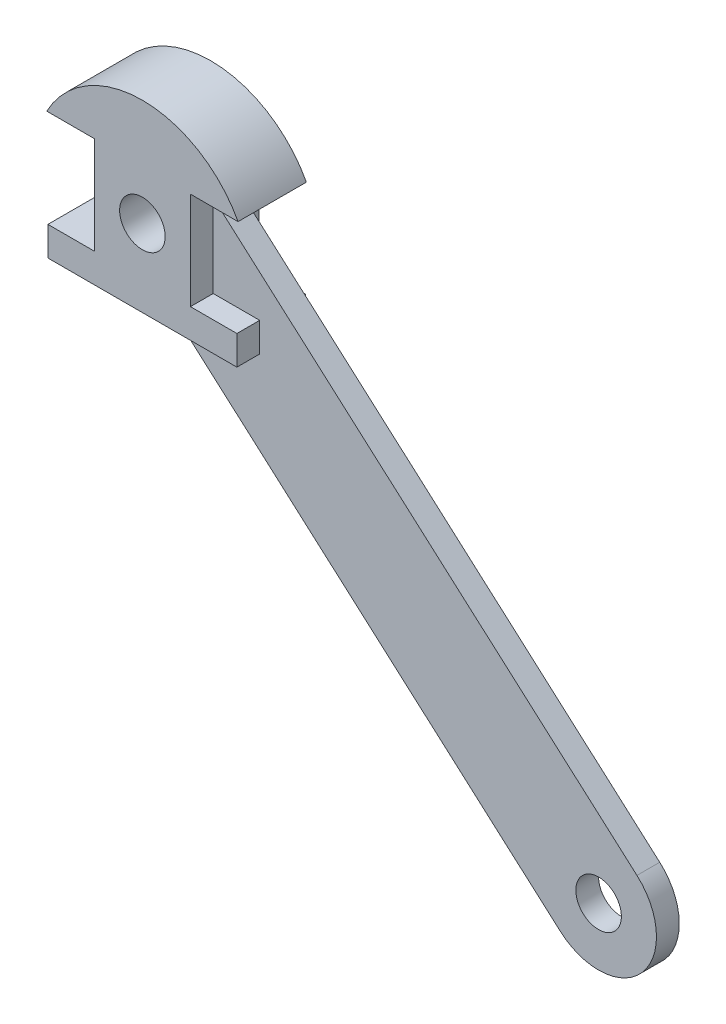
from build123d import *

# Parameters (mm, degrees)
BOSS_EXTRUDE2_DEPTH     = 15
CUT_EXTRUDE2_DEPTH      = 34.009503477
CUT_EXTRUDE2_DEPTH_BACK = 34.009503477
SKETCH4_R               = 5
BOSS_EXTRUDE3_DEPTH     = 5
SKETCH6_R               = 5
CUT_EXTRUDE3_DEPTH      = 146.275741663
SKETCH7_R               = 5
CUT_EXTRUDE4_DEPTH      = 146.275741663


with BuildPart() as part:
    # Sketch3 → Boss-Extrude2 (new body)
    with BuildSketch(Plane.XY):
        with BuildLine():
            Line((-20.74, -16.94245), (20.74, -16.94245))
            Line((20.74, -16.94245), (20.74, -10.5429))
            Line((20.74, -10.5429), (10.54169, -10.5429))
            Line((10.54169, -10.5429), (10.54169, 10.84581))
            Line((10.54169, 10.84581), (20.99169, 10.84581))
            ThreePointArc((20.99169, 10.84581), (0, 23.430242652), (-20.99169, 10.84581))
            Line((-20.99169, 10.84581), (-10.54169, 10.84581))
            Line((-10.54169, 10.84581), (-10.54169, -10.5429))
            Line((-10.54169, -10.5429), (-20.74, -10.5429))
            Line((-20.74, -10.5429), (-20.74, -16.94245))
        make_face()
    extrude(amount=BOSS_EXTRUDE2_DEPTH)

    # Sketch4 → Cut-Extrude2 (cut, two sides: drawn at the far end of the back side and taken through both)
    with BuildSketch(Plane.XY.offset(5).offset(-CUT_EXTRUDE2_DEPTH_BACK)):
        Circle(SKETCH4_R)
    extrude(amount=CUT_EXTRUDE2_DEPTH + CUT_EXTRUDE2_DEPTH_BACK, mode=Mode.SUBTRACT)

    # Sketch5 → Boss-Extrude3 (add)
    with BuildSketch(Plane.XY.offset(5)):
        with BuildLine():
            Line((8.858299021, 9.119782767), (103.532651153, -74.641008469))
            ThreePointArc((103.532651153, -74.641008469), (104.629114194, -92.568020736), (86.702101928, -93.664483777))
            Line((86.702101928, -93.664483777), (-7.972250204, -9.903692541))
            ThreePointArc((-7.972250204, -9.903692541), (-6.922429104, 6.12444792), (8.858299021, 9.119782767))
        make_face()
    extrude(amount=BOSS_EXTRUDE3_DEPTH)

    # Sketch6 → Cut-Extrude3 (cut, through all)
    with BuildSketch(Plane.XY.offset(5)):
        Circle(SKETCH6_R)
    extrude(amount=CUT_EXTRUDE3_DEPTH, mode=Mode.SUBTRACT)

    # Sketch7 → Cut-Extrude4 (cut, through all)
    with BuildSketch(Plane.XY.offset(5)):
        with Locations(Location((95.11737654, -84.152746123, 0), (0, 0, 180))):
            Circle(SKETCH7_R)
    extrude(amount=CUT_EXTRUDE4_DEPTH, mode=Mode.SUBTRACT)


solid = part.part
